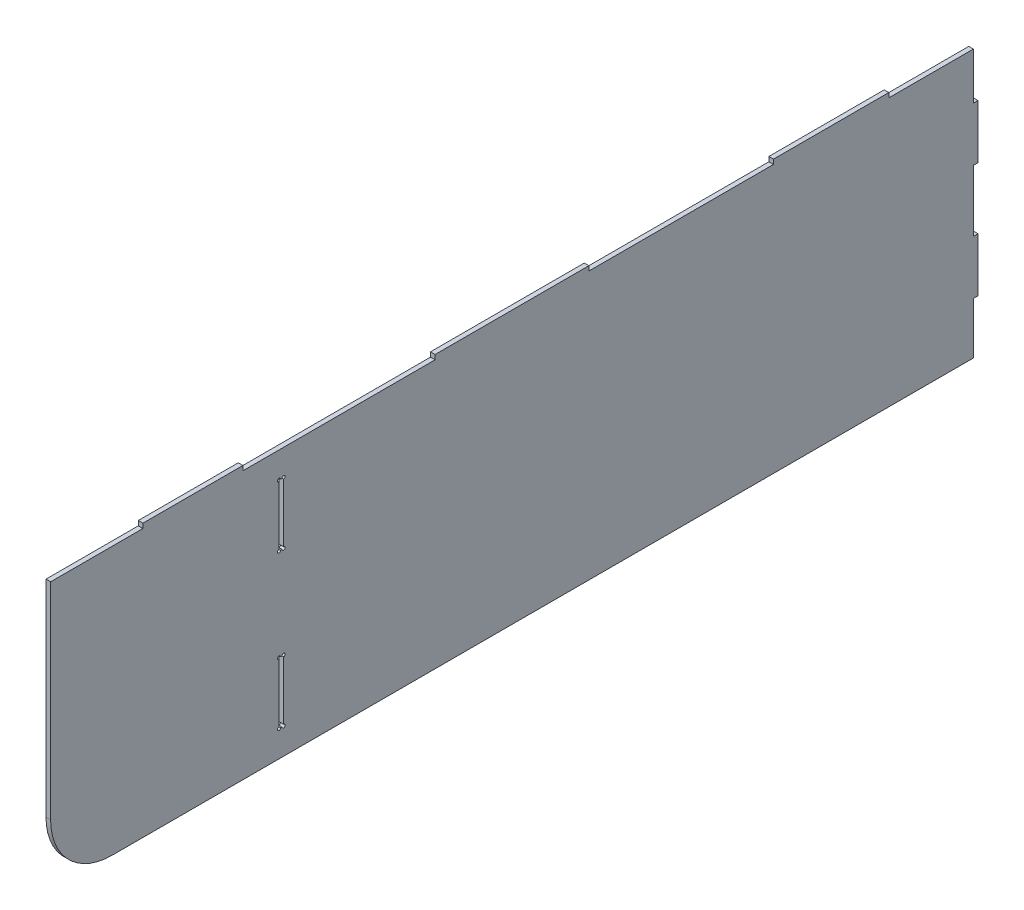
from build123d import *

# Parameters (mm, degrees)
BOSS_EXTRUDE1_DEPTH   = 1200
SKETCH1_W             = 6
SKETCH1_H             = 80
BOSS_EXTRUDE1_2_DEPTH = 1200
SKETCH1_H_2           = 67
BOSS_EXTRUDE1_3_DEPTH = 1200
SKETCH2_W             = 6
SKETCH2_H             = 70
BOSS_EXTRUDE2_DEPTH   = 6
SKETCH3_W             = 6
SKETCH3_H             = 6
CUT_EXTRUDE1_DEPTH    = 1666
SKETCH4_R             = 2
SKETCH4_W             = 6
SKETCH4_H             = 80
CUT_EXTRUDE2_DEPTH    = 1666
SKETCH5_W             = 200
SKETCH5_H             = 12
SKETCH5_W_2           = 130
SKETCH5_W_3           = 150
BOSS_EXTRUDE3_DEPTH   = 6
FILLET1_R             = 80


with BuildPart() as part:
    # Sketch1 → Boss-Extrude1 (new body)
    with BuildSketch(Plane.XY):
        Polygon((-598, 107), (-598, 168), (-598, 174), (-604, 174), (-604, 107), align=None)
    extrude(amount=BOSS_EXTRUDE1_DEPTH)



with BuildPart() as body_2:
    # Sketch1 → Boss-Extrude1 2 (new body)
    with BuildSketch(Plane.XY):
        with Locations((-601, -3)):
            Rectangle(SKETCH1_W, SKETCH1_H)
    extrude(amount=BOSS_EXTRUDE1_2_DEPTH)


with BuildPart() as body_3:
    # Sketch1 → Boss-Extrude1 3 (new body)
    with BuildSketch(Plane.XY):
        with Locations((-601, -146.5)):
            Rectangle(SKETCH1_W, SKETCH1_H_2)
    extrude(amount=BOSS_EXTRUDE1_3_DEPTH)


with BuildPart() as part_1:
    add(part.part)

    add(body_2.part)  # Boss-Extrude2 merges body 2

    add(body_3.part)  # Boss-Extrude2 merges body 3
    # Sketch2 → Boss-Extrude2 (add)
    with BuildSketch(Plane.ZY.offset(604)):
        with Locations((-3, -78)):
            Rectangle(SKETCH2_W, SKETCH2_H)
        with Locations((-3, 72)):
            Rectangle(SKETCH2_W, SKETCH2_H)
        Polygon((1200, 107), (0, 107), (0, 37), (0, -43), (0, -113), (0, -180), (1200, -180), align=None)
    extrude(amount=-BOSS_EXTRUDE2_DEPTH)

    # Sketch3 → Cut-Extrude1 (cut)
    with BuildSketch(Plane.XY.offset(1200)):
        with Locations((-601, 171)):
            Rectangle(SKETCH3_W, SKETCH3_H)
    extrude(amount=-CUT_EXTRUDE1_DEPTH, mode=Mode.SUBTRACT)

    # Sketch4 → Cut-Extrude2 (cut)
    with BuildSketch(Plane.ZY.offset(604)):
        with Locations((897, 54)):
            Circle(SKETCH4_R)
        with Locations((903, 54)):
            Circle(SKETCH4_R)
        with Locations((903, 134)):
            Circle(SKETCH4_R)
        with Locations((897, 134)):
            Circle(SKETCH4_R)
        with Locations((900, 94)):
            Rectangle(SKETCH4_W, SKETCH4_H)
        with BuildLine():
            ThreePointArc((905, 134), (903, 136), (901, 134))
            Line((901, 134), (903, 134))
            Line((903, 134), (903, 132))
            ThreePointArc((903, 132), (904.414213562, 132.585786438), (905, 134))
        make_face()
        with BuildLine():
            Line((903, 134), (901, 134))
            ThreePointArc((901, 134), (901.585786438, 132.585786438), (903, 132))
            Line((903, 132), (903, 134))
        make_face()
        with BuildLine():
            ThreePointArc((905, 134), (903, 136), (901, 134))
            Line((901, 134), (903, 134))
            Line((903, 134), (903, 132))
            ThreePointArc((903, 132), (904.414213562, 132.585786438), (905, 134))
        make_face()
        with BuildLine():
            Line((903, 134), (901, 134))
            ThreePointArc((901, 134), (901.585786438, 132.585786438), (903, 132))
            Line((903, 132), (903, 134))
        make_face()
        with BuildLine():
            Line((897, 132), (897, 134))
            Line((897, 134), (899, 134))
            ThreePointArc((899, 134), (895.585786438, 135.414213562), (897, 132))
        make_face()
        with BuildLine():
            Line((899, 134), (897, 134))
            Line((897, 134), (897, 132))
            ThreePointArc((897, 132), (898.414213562, 132.585786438), (899, 134))
        make_face()
        with BuildLine():
            Line((897, 132), (897, 134))
            Line((897, 134), (899, 134))
            ThreePointArc((899, 134), (895.585786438, 135.414213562), (897, 132))
        make_face()
        with BuildLine():
            Line((899, 134), (897, 134))
            Line((897, 134), (897, 132))
            ThreePointArc((897, 132), (898.414213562, 132.585786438), (899, 134))
        make_face()
        with BuildLine():
            ThreePointArc((905, 54), (904.414213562, 55.414213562), (903, 56))
            Line((903, 56), (903, 54))
            Line((903, 54), (901, 54))
            ThreePointArc((901, 54), (903, 52), (905, 54))
        make_face()
        with BuildLine():
            Line((903, 54), (903, 56))
            ThreePointArc((903, 56), (901.585786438, 55.414213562), (901, 54))
            Line((901, 54), (903, 54))
        make_face()
        with BuildLine():
            ThreePointArc((905, 54), (904.414213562, 55.414213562), (903, 56))
            Line((903, 56), (903, 54))
            Line((903, 54), (901, 54))
            ThreePointArc((901, 54), (903, 52), (905, 54))
        make_face()
        with BuildLine():
            Line((903, 54), (903, 56))
            ThreePointArc((903, 56), (901.585786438, 55.414213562), (901, 54))
            Line((901, 54), (903, 54))
        make_face()
        with BuildLine():
            ThreePointArc((899, 54), (898.414213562, 55.414213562), (897, 56))
            Line((897, 56), (897, 54))
            Line((897, 54), (899, 54))
        make_face()
        with BuildLine():
            Line((897, 54), (897, 56))
            ThreePointArc((897, 56), (895.585786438, 52.585786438), (899, 54))
            Line((899, 54), (897, 54))
        make_face()
        with BuildLine():
            ThreePointArc((899, 54), (898.414213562, 55.414213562), (897, 56))
            Line((897, 56), (897, 54))
            Line((897, 54), (899, 54))
        make_face()
        with BuildLine():
            Line((897, 54), (897, 56))
            ThreePointArc((897, 56), (895.585786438, 52.585786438), (899, 54))
            Line((899, 54), (897, 54))
        make_face()
        with BuildLine():
            ThreePointArc((905, -66), (903, -64), (901, -66))
            Line((901, -66), (903, -66))
            Line((903, -66), (903, -68))
            ThreePointArc((903, -68), (904.414213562, -67.414213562), (905, -66))
        make_face()
        with BuildLine():
            Line((903, -66), (901, -66))
            ThreePointArc((901, -66), (901.585786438, -67.414213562), (903, -68))
            Line((903, -68), (903, -66))
        make_face()
        with BuildLine():
            ThreePointArc((905, -66), (903, -64), (901, -66))
            Line((901, -66), (903, -66))
            Line((903, -66), (903, -68))
            ThreePointArc((903, -68), (904.414213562, -67.414213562), (905, -66))
        make_face()
        with BuildLine():
            Line((903, -66), (901, -66))
            ThreePointArc((901, -66), (901.585786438, -67.414213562), (903, -68))
            Line((903, -68), (903, -66))
        make_face()
        with Locations((897, -146)):
            Circle(SKETCH4_R)
        with Locations((903, -146)):
            Circle(SKETCH4_R)
        with Locations((903, -66)):
            Circle(SKETCH4_R)
        with Locations((897, -66)):
            Circle(SKETCH4_R)
        with Locations((900, -106)):
            Rectangle(SKETCH4_W, SKETCH4_H)
        with BuildLine():
            Line((897, -68), (897, -66))
            Line((897, -66), (899, -66))
            ThreePointArc((899, -66), (895.585786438, -64.585786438), (897, -68))
        make_face()
        with BuildLine():
            Line((899, -66), (897, -66))
            Line((897, -66), (897, -68))
            ThreePointArc((897, -68), (898.414213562, -67.414213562), (899, -66))
        make_face()
        with BuildLine():
            Line((897, -68), (897, -66))
            Line((897, -66), (899, -66))
            ThreePointArc((899, -66), (895.585786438, -64.585786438), (897, -68))
        make_face()
        with BuildLine():
            Line((899, -66), (897, -66))
            Line((897, -66), (897, -68))
            ThreePointArc((897, -68), (898.414213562, -67.414213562), (899, -66))
        make_face()
        with BuildLine():
            ThreePointArc((905, -146), (904.414213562, -144.585786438), (903, -144))
            Line((903, -144), (903, -146))
            Line((903, -146), (901, -146))
            ThreePointArc((901, -146), (903, -148), (905, -146))
        make_face()
        with BuildLine():
            Line((903, -146), (903, -144))
            ThreePointArc((903, -144), (901.585786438, -144.585786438), (901, -146))
            Line((901, -146), (903, -146))
        make_face()
        with BuildLine():
            ThreePointArc((905, -146), (904.414213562, -144.585786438), (903, -144))
            Line((903, -144), (903, -146))
            Line((903, -146), (901, -146))
            ThreePointArc((901, -146), (903, -148), (905, -146))
        make_face()
        with BuildLine():
            Line((903, -146), (903, -144))
            ThreePointArc((903, -144), (901.585786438, -144.585786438), (901, -146))
            Line((901, -146), (903, -146))
        make_face()
        with BuildLine():
            ThreePointArc((899, -146), (898.414213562, -144.585786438), (897, -144))
            Line((897, -144), (897, -146))
            Line((897, -146), (899, -146))
        make_face()
        with BuildLine():
            Line((897, -146), (897, -144))
            ThreePointArc((897, -144), (895.585786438, -147.414213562), (899, -146))
            Line((899, -146), (897, -146))
        make_face()
        with BuildLine():
            ThreePointArc((899, -146), (898.414213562, -144.585786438), (897, -144))
            Line((897, -144), (897, -146))
            Line((897, -146), (899, -146))
        make_face()
        with BuildLine():
            Line((897, -146), (897, -144))
            ThreePointArc((897, -144), (895.585786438, -147.414213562), (899, -146))
            Line((899, -146), (897, -146))
        make_face()
    extrude(amount=-CUT_EXTRUDE2_DEPTH, mode=Mode.SUBTRACT)

    # Sketch5 → Boss-Extrude3 (add)
    with BuildSketch(Plane.ZY.offset(604)):
        with Locations((600, 168)):
            Rectangle(SKETCH5_W, SKETCH5_H)
        with Locations((1015, 168)):
            Rectangle(SKETCH5_W_2, SKETCH5_H)
        with Locations((185, 168)):
            Rectangle(SKETCH5_W_3, SKETCH5_H)
    extrude(amount=-BOSS_EXTRUDE3_DEPTH)

    # Fillet1
    fillet1_edges = [part_1.edges().sort_by_distance(p)[0] for p in [
        (-601, -180, 1200),
    ]]
    fillet(fillet1_edges, radius=FILLET1_R)


solid = part_1.part
